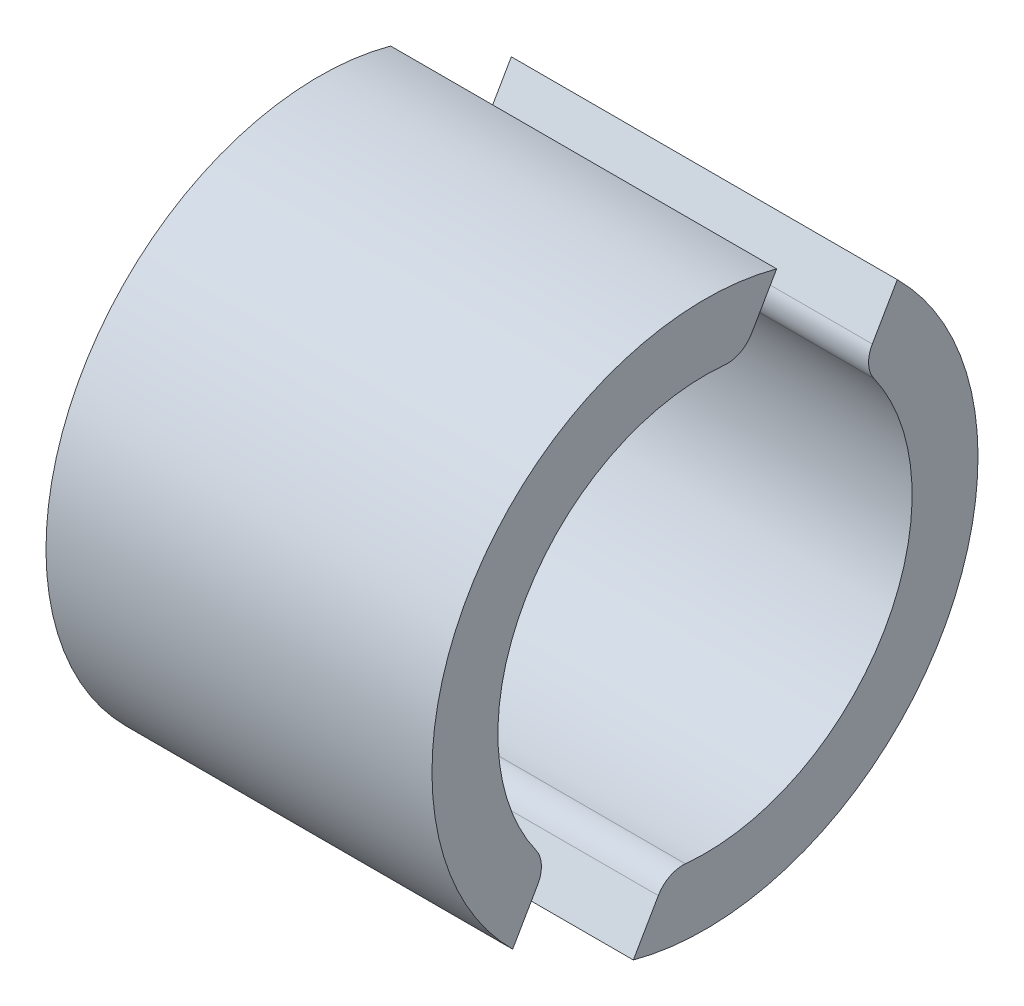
ISO-10303-21;
HEADER;
FILE_DESCRIPTION(('STEP AP214'),'2;1');
FILE_NAME('part.step','',(''),(''),'','','');
FILE_SCHEMA(('AUTOMOTIVE_DESIGN { 1 0 10303 214 1 1 1 1 }'));
ENDSEC;
DATA;
#1=APPLICATION_CONTEXT('core data for automotive mechanical design processes');
#2=APPLICATION_PROTOCOL_DEFINITION('international standard','automotive_design',2000,#1);
#3=PRODUCT_CONTEXT('',#1,'mechanical');
#4=PRODUCT('Part','Part','',(#3));
#5=PRODUCT_RELATED_PRODUCT_CATEGORY('part','',(#4));
#6=PRODUCT_DEFINITION_FORMATION('','',#4);
#7=PRODUCT_DEFINITION_CONTEXT('part definition',#1,'design');
#8=PRODUCT_DEFINITION('design','',#6,#7);
#9=PRODUCT_DEFINITION_SHAPE('','',#8);
#10=(LENGTH_UNIT() NAMED_UNIT(*) SI_UNIT(.MILLI.,.METRE.));
#11=(NAMED_UNIT(*) PLANE_ANGLE_UNIT() SI_UNIT($,.RADIAN.));
#12=(NAMED_UNIT(*) SI_UNIT($,.STERADIAN.) SOLID_ANGLE_UNIT());
#13=UNCERTAINTY_MEASURE_WITH_UNIT(LENGTH_MEASURE(1.E-05),#10,'distance_accuracy_value','');
#14=(GEOMETRIC_REPRESENTATION_CONTEXT(3) GLOBAL_UNCERTAINTY_ASSIGNED_CONTEXT((#13)) GLOBAL_UNIT_ASSIGNED_CONTEXT((#10,
#11,#12)) REPRESENTATION_CONTEXT('',''));
#15=CARTESIAN_POINT('',(0.,0.,0.));
#16=DIRECTION('',(0.,0.,1.));
#17=DIRECTION('',(1.,0.,0.));
#18=AXIS2_PLACEMENT_3D('',#15,#16,#17);
#19=CARTESIAN_POINT('',(47.,0.,0.));
#20=DIRECTION('',(1.,0.,0.));
#21=DIRECTION('',(0.,0.,-1.));
#22=AXIS2_PLACEMENT_3D('',#19,#20,#21);
#23=PLANE('',#22);
#24=CARTESIAN_POINT('',(47.,0.,0.));
#25=DIRECTION('',(1.,0.,0.));
#26=DIRECTION('',(0.,0.,-1.));
#27=AXIS2_PLACEMENT_3D('',#24,#25,#26);
#28=CIRCLE('',#27,22.);
#29=CARTESIAN_POINT('',(47.,-21.9017228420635,2.07714625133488));
#30=VERTEX_POINT('',#29);
#31=CARTESIAN_POINT('',(47.,12.7497228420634,-17.9288752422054));
#32=VERTEX_POINT('',#31);
#33=EDGE_CURVE('E109',#30,#32,#28,.T.);
#34=ORIENTED_EDGE('',*,*,#33,.F.);
#35=CARTESIAN_POINT('',(47.,-24.8883214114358,2.360393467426));
#36=DIRECTION('',(1.,0.,0.));
#37=DIRECTION('',(0.,0.,-1.));
#38=AXIS2_PLACEMENT_3D('',#35,#36,#37);
#39=CIRCLE('',#38,3.);
#40=CARTESIAN_POINT('',(47.,-23.3883214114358,4.95846967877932));
#41=VERTEX_POINT('',#40);
#42=EDGE_CURVE('E133',#30,#41,#39,.T.);
#43=ORIENTED_EDGE('',*,*,#42,.T.);
#44=DIRECTION('',(0.,0.86602540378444,-0.499999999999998));
#45=VECTOR('',#44,1.);
#46=CARTESIAN_POINT('',(47.,20.5833276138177,-20.4285737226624));
#47=LINE('',#46,#45);
#48=CARTESIAN_POINT('',(47.,-27.9833276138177,7.61139774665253));
#49=VERTEX_POINT('',#48);
#50=EDGE_CURVE('E119',#49,#41,#47,.T.);
#51=ORIENTED_EDGE('',*,*,#50,.F.);
#52=CARTESIAN_POINT('',(47.,0.,0.));
#53=DIRECTION('',(1.,0.,0.));
#54=DIRECTION('',(0.,0.,-1.));
#55=AXIS2_PLACEMENT_3D('',#52,#53,#54);
#56=CIRCLE('',#55,29.);
#57=CARTESIAN_POINT('',(47.,20.5833276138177,-20.4285737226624));
#58=VERTEX_POINT('',#57);
#59=EDGE_CURVE('E113',#49,#58,#56,.T.);
#60=ORIENTED_EDGE('',*,*,#59,.T.);
#61=CARTESIAN_POINT('',(47.,15.9883214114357,-17.7756456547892));
#62=VERTEX_POINT('',#61);
#63=EDGE_CURVE('E105',#62,#58,#47,.T.);
#64=ORIENTED_EDGE('',*,*,#63,.F.);
#65=CARTESIAN_POINT('',(47.,14.4883214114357,-20.3737218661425));
#66=DIRECTION('',(1.,0.,0.));
#67=DIRECTION('',(0.,0.,-1.));
#68=AXIS2_PLACEMENT_3D('',#65,#66,#67);
#69=CIRCLE('',#68,3.);
#70=EDGE_CURVE('E131',#62,#32,#69,.T.);
#71=ORIENTED_EDGE('',*,*,#70,.T.);
#72=EDGE_LOOP('',(#34,#43,#51,#60,#64,#71));
#73=FACE_BOUND('',#72,.T.);
#74=ADVANCED_FACE('F41',(#73),#23,.T.);
#75=CARTESIAN_POINT('',(6.,33.,0.));
#76=DIRECTION('',(1.,0.,0.));
#77=DIRECTION('',(0.,0.,-1.));
#78=AXIS2_PLACEMENT_3D('',#75,#76,#77);
#79=PLANE('',#78);
#80=DIRECTION('',(0.,0.86602540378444,-0.499999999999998));
#81=VECTOR('',#80,1.);
#82=CARTESIAN_POINT('',(6.00000000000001,20.5833276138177,-20.4285737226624));
#83=LINE('',#82,#81);
#84=CARTESIAN_POINT('',(6.00000000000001,-27.9833276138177,7.61139774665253));
#85=VERTEX_POINT('',#84);
#86=CARTESIAN_POINT('',(6.00000000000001,-23.3883214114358,4.95846967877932));
#87=VERTEX_POINT('',#86);
#88=EDGE_CURVE('E100',#85,#87,#83,.T.);
#89=ORIENTED_EDGE('',*,*,#88,.T.);
#90=CARTESIAN_POINT('',(6.00000000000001,-24.8883214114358,2.360393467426));
#91=DIRECTION('',(1.,0.,0.));
#92=DIRECTION('',(0.,0.,-1.));
#93=AXIS2_PLACEMENT_3D('',#90,#91,#92);
#94=CIRCLE('',#93,3.);
#95=CARTESIAN_POINT('',(6.00000000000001,-21.9017228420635,2.07714625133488));
#96=VERTEX_POINT('',#95);
#97=EDGE_CURVE('E49',#87,#96,#94,.F.);
#98=ORIENTED_EDGE('',*,*,#97,.T.);
#99=CARTESIAN_POINT('',(6.00000000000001,0.,0.));
#100=DIRECTION('',(1.,0.,0.));
#101=DIRECTION('',(0.,0.,-1.));
#102=AXIS2_PLACEMENT_3D('',#99,#100,#101);
#103=CIRCLE('',#102,22.);
#104=CARTESIAN_POINT('',(6.00000000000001,12.7497228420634,-17.9288752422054));
#105=VERTEX_POINT('',#104);
#106=EDGE_CURVE('E120',#105,#96,#103,.F.);
#107=ORIENTED_EDGE('',*,*,#106,.F.);
#108=CARTESIAN_POINT('',(6.00000000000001,14.4883214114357,-20.3737218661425));
#109=DIRECTION('',(1.,0.,0.));
#110=DIRECTION('',(0.,0.,-1.));
#111=AXIS2_PLACEMENT_3D('',#108,#109,#110);
#112=CIRCLE('',#111,3.);
#113=CARTESIAN_POINT('',(6.,15.9883214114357,-17.7756456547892));
#114=VERTEX_POINT('',#113);
#115=EDGE_CURVE('E56',#105,#114,#112,.F.);
#116=ORIENTED_EDGE('',*,*,#115,.T.);
#117=DIRECTION('',(0.,0.86602540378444,-0.499999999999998));
#118=VECTOR('',#117,1.);
#119=CARTESIAN_POINT('',(6.,21.05,-20.6980071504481));
#120=LINE('',#119,#118);
#121=CARTESIAN_POINT('',(6.00000000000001,20.5833276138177,-20.4285737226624));
#122=VERTEX_POINT('',#121);
#123=EDGE_CURVE('E92',#114,#122,#120,.T.);
#124=ORIENTED_EDGE('',*,*,#123,.T.);
#125=CARTESIAN_POINT('',(6.00000000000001,0.,0.));
#126=DIRECTION('',(1.,0.,0.));
#127=DIRECTION('',(0.,0.,-1.));
#128=AXIS2_PLACEMENT_3D('',#125,#126,#127);
#129=CIRCLE('',#128,29.);
#130=EDGE_CURVE('E96',#122,#85,#129,.F.);
#131=ORIENTED_EDGE('',*,*,#130,.T.);
#132=EDGE_LOOP('',(#89,#98,#107,#116,#124,#131));
#133=FACE_BOUND('',#132,.T.);
#134=ADVANCED_FACE('F94',(#133),#79,.F.);
#135=CARTESIAN_POINT('',(-82.0243866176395,0.,0.));
#136=DIRECTION('',(1.,0.,0.));
#137=DIRECTION('',(0.,0.,-1.));
#138=AXIS2_PLACEMENT_3D('',#135,#136,#137);
#139=CYLINDRICAL_SURFACE('',#138,29.);
#140=DIRECTION('',(1.,0.,0.));
#141=VECTOR('',#140,1.);
#142=CARTESIAN_POINT('',(6.00000000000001,20.5833276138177,-20.4285737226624));
#143=LINE('',#142,#141);
#144=EDGE_CURVE('E99',#122,#58,#143,.T.);
#145=ORIENTED_EDGE('',*,*,#144,.T.);
#146=ORIENTED_EDGE('',*,*,#59,.F.);
#147=DIRECTION('',(1.,0.,0.));
#148=VECTOR('',#147,1.);
#149=CARTESIAN_POINT('',(6.00000000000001,-27.9833276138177,7.61139774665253));
#150=LINE('',#149,#148);
#151=EDGE_CURVE('E112',#85,#49,#150,.T.);
#152=ORIENTED_EDGE('',*,*,#151,.F.);
#153=ORIENTED_EDGE('',*,*,#130,.F.);
#154=EDGE_LOOP('',(#145,#146,#152,#153));
#155=FACE_BOUND('',#154,.T.);
#156=ADVANCED_FACE('F43',(#155),#139,.T.);
#157=CARTESIAN_POINT('',(-82.0243866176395,0.,0.));
#158=DIRECTION('',(1.,0.,0.));
#159=DIRECTION('',(0.,0.,-1.));
#160=AXIS2_PLACEMENT_3D('',#157,#158,#159);
#161=CYLINDRICAL_SURFACE('',#160,22.);
#162=ORIENTED_EDGE('',*,*,#106,.T.);
#163=DIRECTION('',(1.,0.,0.));
#164=VECTOR('',#163,1.);
#165=CARTESIAN_POINT('',(-82.0243866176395,-21.9017228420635,2.07714625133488));
#166=LINE('',#165,#164);
#167=EDGE_CURVE('E128',#96,#30,#166,.T.);
#168=ORIENTED_EDGE('',*,*,#167,.T.);
#169=ORIENTED_EDGE('',*,*,#33,.T.);
#170=DIRECTION('',(1.,0.,0.));
#171=VECTOR('',#170,1.);
#172=CARTESIAN_POINT('',(-82.0243866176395,12.7497228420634,-17.9288752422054));
#173=LINE('',#172,#171);
#174=EDGE_CURVE('E125',#32,#105,#173,.F.);
#175=ORIENTED_EDGE('',*,*,#174,.T.);
#176=EDGE_LOOP('',(#162,#168,#169,#175));
#177=FACE_BOUND('',#176,.T.);
#178=ADVANCED_FACE('F140',(#177),#161,.F.);
#179=CARTESIAN_POINT('',(6.00000000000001,20.5833276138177,-20.4285737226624));
#180=DIRECTION('',(0.,-0.499999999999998,-0.86602540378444));
#181=DIRECTION('',(0.,0.86602540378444,-0.499999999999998));
#182=AXIS2_PLACEMENT_3D('',#179,#180,#181);
#183=PLANE('',#182);
#184=ORIENTED_EDGE('',*,*,#123,.F.);
#185=DIRECTION('',(1.,0.,0.));
#186=VECTOR('',#185,1.);
#187=CARTESIAN_POINT('',(6.00000000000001,15.9883214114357,-17.7756456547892));
#188=LINE('',#187,#186);
#189=EDGE_CURVE('E12',#114,#62,#188,.T.);
#190=ORIENTED_EDGE('',*,*,#189,.T.);
#191=ORIENTED_EDGE('',*,*,#63,.T.);
#192=ORIENTED_EDGE('',*,*,#144,.F.);
#193=EDGE_LOOP('',(#184,#190,#191,#192));
#194=FACE_BOUND('',#193,.T.);
#195=ADVANCED_FACE('F103',(#194),#183,.F.);
#196=ORIENTED_EDGE('',*,*,#50,.T.);
#197=DIRECTION('',(1.,0.,0.));
#198=VECTOR('',#197,1.);
#199=CARTESIAN_POINT('',(6.00000000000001,-23.3883214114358,4.95846967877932));
#200=LINE('',#199,#198);
#201=EDGE_CURVE('E64',#41,#87,#200,.F.);
#202=ORIENTED_EDGE('',*,*,#201,.T.);
#203=ORIENTED_EDGE('',*,*,#88,.F.);
#204=ORIENTED_EDGE('',*,*,#151,.T.);
#205=EDGE_LOOP('',(#196,#202,#203,#204));
#206=FACE_BOUND('',#205,.T.);
#207=ADVANCED_FACE('F146',(#206),#183,.F.);
#208=CARTESIAN_POINT('',(-82.0243866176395,-24.8883214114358,2.360393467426));
#209=DIRECTION('',(1.,0.,0.));
#210=DIRECTION('',(0.,0.,-1.));
#211=AXIS2_PLACEMENT_3D('',#208,#209,#210);
#212=CYLINDRICAL_SURFACE('',#211,3.);
#213=ORIENTED_EDGE('',*,*,#97,.F.);
#214=ORIENTED_EDGE('',*,*,#201,.F.);
#215=ORIENTED_EDGE('',*,*,#42,.F.);
#216=ORIENTED_EDGE('',*,*,#167,.F.);
#217=EDGE_LOOP('',(#213,#214,#215,#216));
#218=FACE_BOUND('',#217,.T.);
#219=ADVANCED_FACE('F143',(#218),#212,.T.);
#220=CARTESIAN_POINT('',(-82.0243866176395,14.4883214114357,-20.3737218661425));
#221=DIRECTION('',(1.,0.,0.));
#222=DIRECTION('',(0.,0.,-1.));
#223=AXIS2_PLACEMENT_3D('',#220,#221,#222);
#224=CYLINDRICAL_SURFACE('',#223,3.);
#225=ORIENTED_EDGE('',*,*,#70,.F.);
#226=ORIENTED_EDGE('',*,*,#189,.F.);
#227=ORIENTED_EDGE('',*,*,#115,.F.);
#228=ORIENTED_EDGE('',*,*,#174,.F.);
#229=EDGE_LOOP('',(#225,#226,#227,#228));
#230=FACE_BOUND('',#229,.T.);
#231=ADVANCED_FACE('F154',(#230),#224,.T.);
#232=CLOSED_SHELL('',(#74,#134,#156,#178,#195,#207,#219,#231));
#233=MANIFOLD_SOLID_BREP('B2',#232);
#234=CARTESIAN_POINT('',(6.,33.,0.));
#235=DIRECTION('',(1.,0.,0.));
#236=DIRECTION('',(0.,0.,-1.));
#237=AXIS2_PLACEMENT_3D('',#234,#235,#236);
#238=PLANE('',#237);
#239=DIRECTION('',(0.,-0.86602540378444,0.499999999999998));
#240=VECTOR('',#239,1.);
#241=CARTESIAN_POINT('',(6.00000000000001,27.9833276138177,-7.61139774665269));
#242=LINE('',#241,#240);
#243=CARTESIAN_POINT('',(6.00000000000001,27.9833276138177,-7.61139774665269));
#244=VERTEX_POINT('',#243);
#245=CARTESIAN_POINT('',(6.00000000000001,23.3883214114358,-4.95846967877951));
#246=VERTEX_POINT('',#245);
#247=EDGE_CURVE('E270',#244,#246,#242,.T.);
#248=ORIENTED_EDGE('',*,*,#247,.T.);
#249=CARTESIAN_POINT('',(6.00000000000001,24.8883214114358,-2.36039346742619));
#250=DIRECTION('',(1.,0.,0.));
#251=DIRECTION('',(0.,0.,-1.));
#252=AXIS2_PLACEMENT_3D('',#249,#250,#251);
#253=CIRCLE('',#252,3.);
#254=CARTESIAN_POINT('',(6.00000000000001,21.9017228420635,-2.07714625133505));
#255=VERTEX_POINT('',#254);
#256=EDGE_CURVE('E223',#246,#255,#253,.F.);
#257=ORIENTED_EDGE('',*,*,#256,.T.);
#258=CARTESIAN_POINT('',(6.00000000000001,0.,0.));
#259=DIRECTION('',(1.,0.,0.));
#260=DIRECTION('',(0.,0.,-1.));
#261=AXIS2_PLACEMENT_3D('',#258,#259,#260);
#262=CIRCLE('',#261,22.);
#263=CARTESIAN_POINT('',(6.00000000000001,-12.7497228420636,17.9288752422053));
#264=VERTEX_POINT('',#263);
#265=EDGE_CURVE('E288',#264,#255,#262,.F.);
#266=ORIENTED_EDGE('',*,*,#265,.F.);
#267=CARTESIAN_POINT('',(6.00000000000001,-14.4883214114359,20.3737218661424));
#268=DIRECTION('',(1.,0.,0.));
#269=DIRECTION('',(0.,0.,-1.));
#270=AXIS2_PLACEMENT_3D('',#267,#268,#269);
#271=CIRCLE('',#270,3.);
#272=CARTESIAN_POINT('',(6.,-15.9883214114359,17.7756456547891));
#273=VERTEX_POINT('',#272);
#274=EDGE_CURVE('E230',#264,#273,#271,.F.);
#275=ORIENTED_EDGE('',*,*,#274,.T.);
#276=DIRECTION('',(0.,-0.86602540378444,0.499999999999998));
#277=VECTOR('',#276,1.);
#278=CARTESIAN_POINT('',(6.,28.45,-7.88083117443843));
#279=LINE('',#278,#277);
#280=CARTESIAN_POINT('',(6.00000000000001,-20.5833276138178,20.4285737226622));
#281=VERTEX_POINT('',#280);
#282=EDGE_CURVE('E298',#273,#281,#279,.T.);
#283=ORIENTED_EDGE('',*,*,#282,.T.);
#284=CARTESIAN_POINT('',(6.00000000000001,0.,0.));
#285=DIRECTION('',(1.,0.,0.));
#286=DIRECTION('',(0.,0.,-1.));
#287=AXIS2_PLACEMENT_3D('',#284,#285,#286);
#288=CIRCLE('',#287,29.);
#289=EDGE_CURVE('E292',#281,#244,#288,.F.);
#290=ORIENTED_EDGE('',*,*,#289,.T.);
#291=EDGE_LOOP('',(#248,#257,#266,#275,#283,#290));
#292=FACE_BOUND('',#291,.T.);
#293=ADVANCED_FACE('F215',(#292),#238,.F.);
#294=CARTESIAN_POINT('',(-82.0243866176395,0.,0.));
#295=DIRECTION('',(1.,0.,0.));
#296=DIRECTION('',(0.,0.,-1.));
#297=AXIS2_PLACEMENT_3D('',#294,#295,#296);
#298=CYLINDRICAL_SURFACE('',#297,22.);
#299=ORIENTED_EDGE('',*,*,#265,.T.);
#300=DIRECTION('',(1.,0.,0.));
#301=VECTOR('',#300,1.);
#302=CARTESIAN_POINT('',(-82.0243866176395,21.9017228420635,-2.07714625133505));
#303=LINE('',#302,#301);
#304=CARTESIAN_POINT('',(47.,21.9017228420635,-2.07714625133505));
#305=VERTEX_POINT('',#304);
#306=EDGE_CURVE('E303',#255,#305,#303,.T.);
#307=ORIENTED_EDGE('',*,*,#306,.T.);
#308=CARTESIAN_POINT('',(47.,0.,0.));
#309=DIRECTION('',(1.,0.,0.));
#310=DIRECTION('',(0.,0.,-1.));
#311=AXIS2_PLACEMENT_3D('',#308,#309,#310);
#312=CIRCLE('',#311,22.);
#313=CARTESIAN_POINT('',(47.,-12.7497228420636,17.9288752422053));
#314=VERTEX_POINT('',#313);
#315=EDGE_CURVE('E289',#305,#314,#312,.T.);
#316=ORIENTED_EDGE('',*,*,#315,.T.);
#317=DIRECTION('',(1.,0.,0.));
#318=VECTOR('',#317,1.);
#319=CARTESIAN_POINT('',(-82.0243866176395,-12.7497228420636,17.9288752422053));
#320=LINE('',#319,#318);
#321=EDGE_CURVE('E300',#314,#264,#320,.F.);
#322=ORIENTED_EDGE('',*,*,#321,.T.);
#323=EDGE_LOOP('',(#299,#307,#316,#322));
#324=FACE_BOUND('',#323,.T.);
#325=ADVANCED_FACE('F314',(#324),#298,.F.);
#326=CARTESIAN_POINT('',(47.,0.,0.));
#327=DIRECTION('',(1.,0.,0.));
#328=DIRECTION('',(0.,0.,-1.));
#329=AXIS2_PLACEMENT_3D('',#326,#327,#328);
#330=PLANE('',#329);
#331=ORIENTED_EDGE('',*,*,#315,.F.);
#332=CARTESIAN_POINT('',(47.,24.8883214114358,-2.36039346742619));
#333=DIRECTION('',(1.,0.,0.));
#334=DIRECTION('',(0.,0.,-1.));
#335=AXIS2_PLACEMENT_3D('',#332,#333,#334);
#336=CIRCLE('',#335,3.);
#337=CARTESIAN_POINT('',(47.,23.3883214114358,-4.95846967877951));
#338=VERTEX_POINT('',#337);
#339=EDGE_CURVE('E283',#305,#338,#336,.T.);
#340=ORIENTED_EDGE('',*,*,#339,.T.);
#341=DIRECTION('',(0.,-0.86602540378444,0.499999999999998));
#342=VECTOR('',#341,1.);
#343=CARTESIAN_POINT('',(47.,27.9833276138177,-7.61139774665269));
#344=LINE('',#343,#342);
#345=CARTESIAN_POINT('',(47.,27.9833276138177,-7.61139774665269));
#346=VERTEX_POINT('',#345);
#347=EDGE_CURVE('E269',#346,#338,#344,.T.);
#348=ORIENTED_EDGE('',*,*,#347,.F.);
#349=CARTESIAN_POINT('',(47.,0.,0.));
#350=DIRECTION('',(1.,0.,0.));
#351=DIRECTION('',(0.,0.,-1.));
#352=AXIS2_PLACEMENT_3D('',#349,#350,#351);
#353=CIRCLE('',#352,29.);
#354=CARTESIAN_POINT('',(47.,-20.5833276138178,20.4285737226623));
#355=VERTEX_POINT('',#354);
#356=EDGE_CURVE('E282',#346,#355,#353,.T.);
#357=ORIENTED_EDGE('',*,*,#356,.T.);
#358=CARTESIAN_POINT('',(47.,-15.9883214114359,17.7756456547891));
#359=VERTEX_POINT('',#358);
#360=EDGE_CURVE('E284',#359,#355,#344,.T.);
#361=ORIENTED_EDGE('',*,*,#360,.F.);
#362=CARTESIAN_POINT('',(47.,-14.4883214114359,20.3737218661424));
#363=DIRECTION('',(1.,0.,0.));
#364=DIRECTION('',(0.,0.,-1.));
#365=AXIS2_PLACEMENT_3D('',#362,#363,#364);
#366=CIRCLE('',#365,3.);
#367=EDGE_CURVE('E306',#359,#314,#366,.T.);
#368=ORIENTED_EDGE('',*,*,#367,.T.);
#369=EDGE_LOOP('',(#331,#340,#348,#357,#361,#368));
#370=FACE_BOUND('',#369,.T.);
#371=ADVANCED_FACE('F280',(#370),#330,.T.);
#372=CARTESIAN_POINT('',(-82.0243866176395,0.,0.));
#373=DIRECTION('',(1.,0.,0.));
#374=DIRECTION('',(0.,0.,-1.));
#375=AXIS2_PLACEMENT_3D('',#372,#373,#374);
#376=CYLINDRICAL_SURFACE('',#375,29.);
#377=DIRECTION('',(1.,0.,0.));
#378=VECTOR('',#377,1.);
#379=CARTESIAN_POINT('',(6.00000000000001,-20.5833276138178,20.4285737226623));
#380=LINE('',#379,#378);
#381=EDGE_CURVE('E275',#281,#355,#380,.T.);
#382=ORIENTED_EDGE('',*,*,#381,.T.);
#383=ORIENTED_EDGE('',*,*,#356,.F.);
#384=DIRECTION('',(1.,0.,0.));
#385=VECTOR('',#384,1.);
#386=CARTESIAN_POINT('',(6.00000000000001,27.9833276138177,-7.61139774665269));
#387=LINE('',#386,#385);
#388=EDGE_CURVE('E266',#244,#346,#387,.T.);
#389=ORIENTED_EDGE('',*,*,#388,.F.);
#390=ORIENTED_EDGE('',*,*,#289,.F.);
#391=EDGE_LOOP('',(#382,#383,#389,#390));
#392=FACE_BOUND('',#391,.T.);
#393=ADVANCED_FACE('F217',(#392),#376,.T.);
#394=CARTESIAN_POINT('',(6.00000000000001,27.9833276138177,-7.61139774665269));
#395=DIRECTION('',(0.,0.499999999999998,0.86602540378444));
#396=DIRECTION('',(0.,-0.86602540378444,0.499999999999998));
#397=AXIS2_PLACEMENT_3D('',#394,#395,#396);
#398=PLANE('',#397);
#399=ORIENTED_EDGE('',*,*,#282,.F.);
#400=DIRECTION('',(1.,0.,0.));
#401=VECTOR('',#400,1.);
#402=CARTESIAN_POINT('',(6.00000000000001,-15.9883214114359,17.7756456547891));
#403=LINE('',#402,#401);
#404=EDGE_CURVE('E39',#273,#359,#403,.T.);
#405=ORIENTED_EDGE('',*,*,#404,.T.);
#406=ORIENTED_EDGE('',*,*,#360,.T.);
#407=ORIENTED_EDGE('',*,*,#381,.F.);
#408=EDGE_LOOP('',(#399,#405,#406,#407));
#409=FACE_BOUND('',#408,.T.);
#410=ADVANCED_FACE('F326',(#409),#398,.F.);
#411=ORIENTED_EDGE('',*,*,#347,.T.);
#412=DIRECTION('',(1.,0.,0.));
#413=VECTOR('',#412,1.);
#414=CARTESIAN_POINT('',(6.00000000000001,23.3883214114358,-4.95846967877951));
#415=LINE('',#414,#413);
#416=EDGE_CURVE('E238',#338,#246,#415,.F.);
#417=ORIENTED_EDGE('',*,*,#416,.T.);
#418=ORIENTED_EDGE('',*,*,#247,.F.);
#419=ORIENTED_EDGE('',*,*,#388,.T.);
#420=EDGE_LOOP('',(#411,#417,#418,#419));
#421=FACE_BOUND('',#420,.T.);
#422=ADVANCED_FACE('F268',(#421),#398,.F.);
#423=CARTESIAN_POINT('',(-82.0243866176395,24.8883214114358,-2.36039346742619));
#424=DIRECTION('',(1.,0.,0.));
#425=DIRECTION('',(0.,0.,-1.));
#426=AXIS2_PLACEMENT_3D('',#423,#424,#425);
#427=CYLINDRICAL_SURFACE('',#426,3.);
#428=ORIENTED_EDGE('',*,*,#256,.F.);
#429=ORIENTED_EDGE('',*,*,#416,.F.);
#430=ORIENTED_EDGE('',*,*,#339,.F.);
#431=ORIENTED_EDGE('',*,*,#306,.F.);
#432=EDGE_LOOP('',(#428,#429,#430,#431));
#433=FACE_BOUND('',#432,.T.);
#434=ADVANCED_FACE('F316',(#433),#427,.T.);
#435=CARTESIAN_POINT('',(-82.0243866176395,-14.4883214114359,20.3737218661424));
#436=DIRECTION('',(1.,0.,0.));
#437=DIRECTION('',(0.,0.,-1.));
#438=AXIS2_PLACEMENT_3D('',#435,#436,#437);
#439=CYLINDRICAL_SURFACE('',#438,3.);
#440=ORIENTED_EDGE('',*,*,#367,.F.);
#441=ORIENTED_EDGE('',*,*,#404,.F.);
#442=ORIENTED_EDGE('',*,*,#274,.F.);
#443=ORIENTED_EDGE('',*,*,#321,.F.);
#444=EDGE_LOOP('',(#440,#441,#442,#443));
#445=FACE_BOUND('',#444,.T.);
#446=ADVANCED_FACE('F318',(#445),#439,.T.);
#447=CLOSED_SHELL('',(#293,#325,#371,#393,#410,#422,#434,#446));
#448=MANIFOLD_SOLID_BREP('B6',#447);
#449=ADVANCED_BREP_SHAPE_REPRESENTATION('',(#18,#233,#448),#14);
#450=SHAPE_DEFINITION_REPRESENTATION(#9,#449);
ENDSEC;
END-ISO-10303-21;
